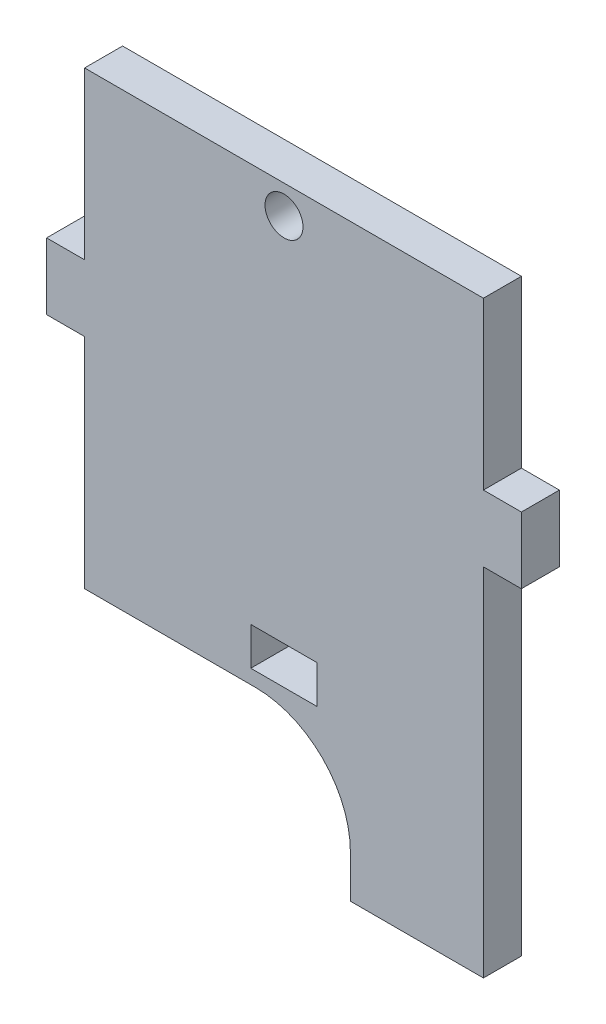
from build123d import *

# Parameters (mm, degrees)
SKETCH1_W           = 7
SKETCH1_H           = 4
SKETCH1_R           = 2
BOSS_EXTRUDE1_DEPTH = 4
FILLET5_R           = 10


with BuildPart() as part:
    # Sketch1 → Boss-Extrude1 (new body)
    with BuildSketch(Plane.XY):
        Polygon((22.451113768, -55.36470609), (22.451113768, -17.86470609), (26.451113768, -17.86470609), (26.451113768, -10.86470609), (22.451113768, -10.86470609), (22.451113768, 6.63529391), (-19.548886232, 6.63529391), (-19.548886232, -10.86470609), (-23.548886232, -10.86470609), (-23.548886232, -17.86470609), (-19.548886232, -17.86470609), (-19.548886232, -40.86470609), (8.441113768, -40.86470609), (8.441113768, -55.36470609), align=None)
        with Locations((1.451113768, -37.36470609)):
            Rectangle(SKETCH1_W, SKETCH1_H, mode=Mode.SUBTRACT)
        with Locations((1.451113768, 3.63529391)):
            Circle(SKETCH1_R, mode=Mode.SUBTRACT)
    extrude(amount=BOSS_EXTRUDE1_DEPTH)

    # Fillet5
    fillet5_edges = [part.edges().sort_by_distance(p)[0] for p in [
        (8.441113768, -40.86470609, 2),
    ]]
    fillet(fillet5_edges, radius=FILLET5_R)


solid = part.part
